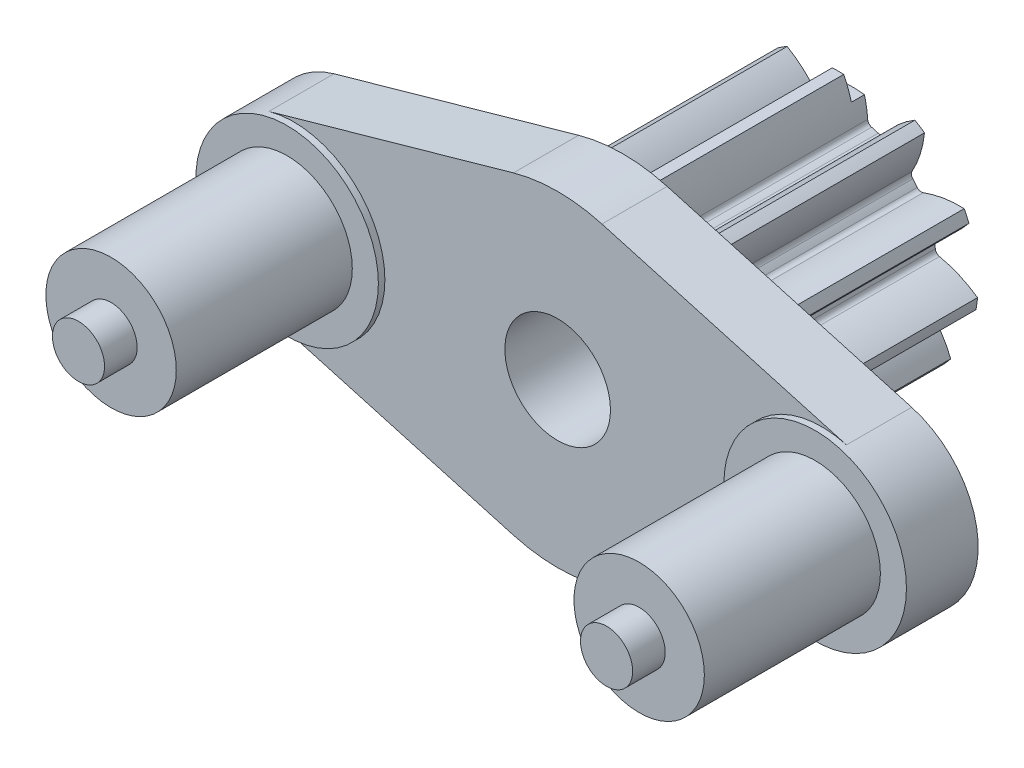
from build123d import *

# Parameters (mm, degrees)
ESQUISSE2_R                  = 9.75
BASE_EXTRUSION_DEPTH         = 17.5
ENL_V_MAT_EXTRU_2_DEPTH      = 17.5
R_P_TITION_CIRCULAIRE1_COUNT = 11
BOSS_EXTRU_1_DEPTH           = 5
ESQUISSE4_R                  = 7
BOSS_EXTRU_2_DEPTH           = 0.5
ESQUISSE5_R                  = 5
BOSS_EXTRU_3_DEPTH           = 13.5
ESQUISSE6_R                  = 2
BOSS_EXTRU_4_DEPTH           = 2.5
ESQUISSE7_R                  = 2.5
ENL_V_MAT_EXTRU_3_DEPTH      = 13
ESQUISSE8_R                  = 3.5
ENL_V_MAT_EXTRU_4_DEPTH      = 2
ESQUISSE9_R                  = 4.05
ENL_V_MAT_EXTRU_5_DEPTH      = 38.484163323
ENL_V_MAT_EXTRU_6_DEPTH      = 1


with BuildPart() as part:
    # Esquisse2 → Base-Extrusion (new body)
    with BuildSketch(Plane.XY):
        Circle(ESQUISSE2_R)
    extrude(amount=BASE_EXTRUSION_DEPTH)

    # Esquisse1 → Enl_v. mat.-Extru.2 (cut)
    with BuildSketch(Plane.XY):
        with BuildLine():
            ThreePointArc((-0.437118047, 9.740196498), (-2.746298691, 9.35523081), (-4.897150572, 8.430920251))
            ThreePointArc((-4.897150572, 8.430920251), (-3.606970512, 7.48377117), (-2.531151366, 6.298752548))
            ThreePointArc((-2.531151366, 6.298752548), (-2.329297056, 6.154981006), (-2.081490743, 6.157710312))
            ThreePointArc((-2.081490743, 6.157710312), (-1.830865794, 6.23682054), (-1.577247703, 6.305734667))
            ThreePointArc((-1.577247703, 6.305734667), (-1.367287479, 6.437386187), (-1.275176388, 6.667453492))
            ThreePointArc((-1.275176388, 6.667453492), (-1.010608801, 8.245952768), (-0.437118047, 9.740196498))
        make_face()
    enl_v_mat_extru_2 = extrude(amount=ENL_V_MAT_EXTRU_2_DEPTH, mode=Mode.SUBTRACT)

    # R_p_tition circulaire1: Enl_v. mat.-Extru.2 ×11 about axis
    r_p_tition_circulaire1_axis = Axis((0, 0, -50), (0, 0, 1))
    for i in range(1, R_P_TITION_CIRCULAIRE1_COUNT):
        add(enl_v_mat_extru_2.rotate(r_p_tition_circulaire1_axis, i * 360 / R_P_TITION_CIRCULAIRE1_COUNT), mode=Mode.SUBTRACT)

    # Esquisse3 → Boss.-Extru.1 (add)
    with BuildSketch(Plane.XY.offset(17.5)):
        with BuildLine():
            Line((-22.151234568, 6.736861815), (-3.395061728, 12.030110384))
            ThreePointArc((-3.395061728, 12.030110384), (0, 12.5), (3.395061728, 12.030110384))
            Line((3.395061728, 12.030110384), (22.151234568, 6.736861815))
            ThreePointArc((22.151234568, 6.736861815), (27.25, 0), (22.151234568, -6.736861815))
            Line((22.151234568, -6.736861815), (3.395061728, -12.030110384))
            ThreePointArc((3.395061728, -12.030110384), (0, -12.5), (-3.395061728, -12.030110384))
            Line((-3.395061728, -12.030110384), (-22.151234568, -6.736861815))
            ThreePointArc((-22.151234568, -6.736861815), (-27.25, 0), (-22.151234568, 6.736861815))
        make_face()
    extrude(amount=BOSS_EXTRU_1_DEPTH)

    # Esquisse4 → Boss.-Extru.2 (add)
    with BuildSketch(Plane.XY.offset(22.5)):
        with Locations(Location((20.25, 0, 0), (0, 0, 74.240207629))):
            Circle(ESQUISSE4_R)
        with Locations(Location((-20.25, 0, 0), (0, 0, 105.759792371))):
            Circle(ESQUISSE4_R)
    extrude(amount=BOSS_EXTRU_2_DEPTH)

    # Esquisse5 → Boss.-Extru.3 (add)
    with BuildSketch(Plane.XY.offset(23)):
        with Locations((20.25, 0)):
            Circle(ESQUISSE5_R)
        with Locations((-20.25, 0)):
            Circle(ESQUISSE5_R)
    extrude(amount=BOSS_EXTRU_3_DEPTH)

    # Esquisse6 → Boss.-Extru.4 (add)
    with BuildSketch(Plane.XY.offset(36.5)):
        with Locations((20.25, 0)):
            Circle(ESQUISSE6_R)
        with Locations((-20.25, 0)):
            Circle(ESQUISSE6_R)
    extrude(amount=BOSS_EXTRU_4_DEPTH)

    # Esquisse7 → Enl_v. mat.-Extru.3 (cut)
    with BuildSketch(Plane(origin=(0, 0, 17.5), x_dir=(-1, 0, 0), z_dir=(0, 0, -1))):
        with Locations((-20, 0)):
            Circle(ESQUISSE7_R)
        with Locations((20.25, 0)):
            Circle(ESQUISSE7_R)
    extrude(amount=-ENL_V_MAT_EXTRU_3_DEPTH, mode=Mode.SUBTRACT)

    # Esquisse8 → Enl_v. mat.-Extru.4 (cut)
    with BuildSketch(Plane(origin=(0, 0, 17.5), x_dir=(-1, 0, 0), z_dir=(0, 0, -1))):
        with Locations((20.25, 0)):
            Circle(ESQUISSE8_R)
        with Locations((-20.25, 0)):
            Circle(ESQUISSE8_R)
    extrude(amount=-ENL_V_MAT_EXTRU_4_DEPTH, mode=Mode.SUBTRACT)

    # Esquisse9 → Enl_v. mat.-Extru.5 (cut, through all)
    with BuildSketch(Plane.XY.offset(22.5)):
        Circle(ESQUISSE9_R)
    extrude(amount=-ENL_V_MAT_EXTRU_5_DEPTH, mode=Mode.SUBTRACT)

    # Esquisse10 → Enl_v. mat.-Extru.6 (cut)
    with BuildSketch(Plane(origin=(0, 0, 0), x_dir=(-1, 0, 0), z_dir=(0, 0, -1))):
        with BuildLine():
            Line((-1.970664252, 8.01117859), (-3.804204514, 15.464918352))
            Line((-3.804204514, 15.464918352), (3.804204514, 15.464918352))
            Line((3.804204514, 15.464918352), (1.970664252, 8.01117859))
            ThreePointArc((1.970664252, 8.01117859), (0, 8.25), (-1.970664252, 8.01117859))
        make_face()
    extrude(amount=-ENL_V_MAT_EXTRU_6_DEPTH, mode=Mode.SUBTRACT)


solid = part.part
